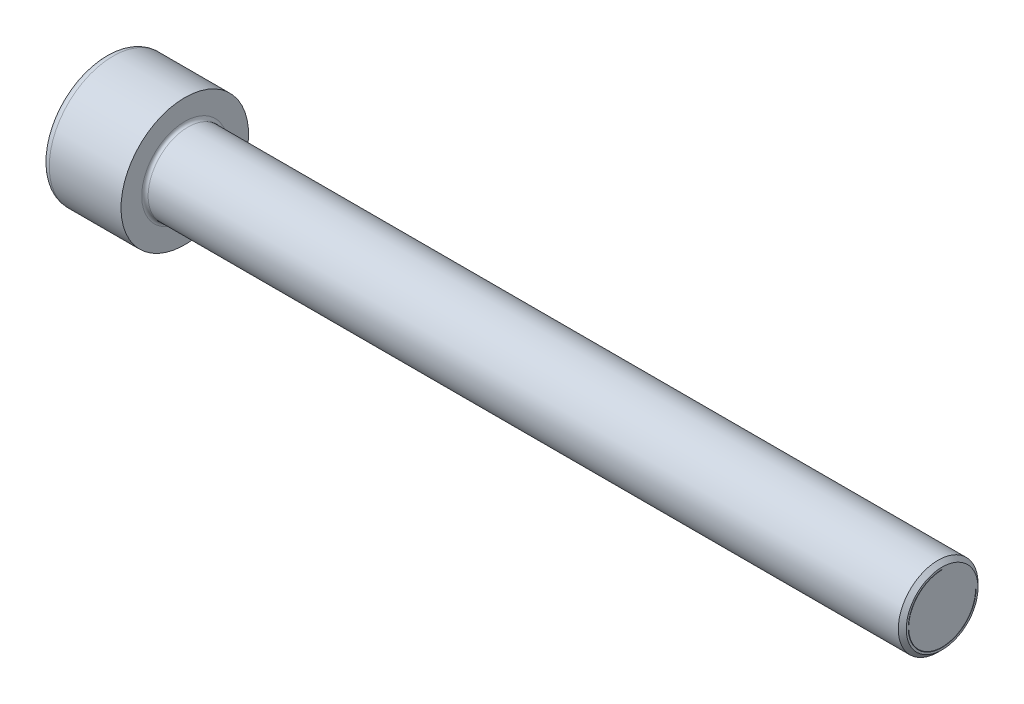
ISO-10303-21;
HEADER;
FILE_DESCRIPTION(('STEP AP214'),'2;1');
FILE_NAME('part.step','',(''),(''),'','','');
FILE_SCHEMA(('AUTOMOTIVE_DESIGN { 1 0 10303 214 1 1 1 1 }'));
ENDSEC;
DATA;
#1=APPLICATION_CONTEXT('core data for automotive mechanical design processes');
#2=APPLICATION_PROTOCOL_DEFINITION('international standard','automotive_design',2000,#1);
#3=PRODUCT_CONTEXT('',#1,'mechanical');
#4=PRODUCT('Part','Part','',(#3));
#5=PRODUCT_RELATED_PRODUCT_CATEGORY('part','',(#4));
#6=PRODUCT_DEFINITION_FORMATION('','',#4);
#7=PRODUCT_DEFINITION_CONTEXT('part definition',#1,'design');
#8=PRODUCT_DEFINITION('design','',#6,#7);
#9=PRODUCT_DEFINITION_SHAPE('','',#8);
#10=(LENGTH_UNIT() NAMED_UNIT(*) SI_UNIT(.MILLI.,.METRE.));
#11=(NAMED_UNIT(*) PLANE_ANGLE_UNIT() SI_UNIT($,.RADIAN.));
#12=(NAMED_UNIT(*) SI_UNIT($,.STERADIAN.) SOLID_ANGLE_UNIT());
#13=UNCERTAINTY_MEASURE_WITH_UNIT(LENGTH_MEASURE(1.E-05),#10,'distance_accuracy_value','');
#14=(GEOMETRIC_REPRESENTATION_CONTEXT(3) GLOBAL_UNCERTAINTY_ASSIGNED_CONTEXT((#13)) GLOBAL_UNIT_ASSIGNED_CONTEXT((#10,
#11,#12)) REPRESENTATION_CONTEXT('',''));
#15=CARTESIAN_POINT('',(0.,0.,0.));
#16=DIRECTION('',(0.,0.,1.));
#17=DIRECTION('',(1.,0.,0.));
#18=AXIS2_PLACEMENT_3D('',#15,#16,#17);
#19=CARTESIAN_POINT('',(62.9999999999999,2.5,0.));
#20=DIRECTION('',(1.,0.,0.));
#21=DIRECTION('',(0.,0.,-1.));
#22=AXIS2_PLACEMENT_3D('',#19,#20,#21);
#23=PLANE('',#22);
#24=DIRECTION('',(0.,0.,1.));
#25=VECTOR('',#24,1.);
#26=CARTESIAN_POINT('',(62.9999999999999,0.,-2.1125));
#27=LINE('',#26,#25);
#28=CARTESIAN_POINT('',(62.9999999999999,0.,-4.25000000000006));
#29=VERTEX_POINT('',#28);
#30=CARTESIAN_POINT('',(62.9999999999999,0.,-4.20000000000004));
#31=VERTEX_POINT('',#30);
#32=EDGE_CURVE('E298',#29,#31,#27,.T.);
#33=ORIENTED_EDGE('',*,*,#32,.T.);
#34=CARTESIAN_POINT('',(62.9999999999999,0.,0.));
#35=DIRECTION('',(-1.,0.,0.));
#36=DIRECTION('',(0.,1.,0.));
#37=AXIS2_PLACEMENT_3D('',#34,#35,#36);
#38=CIRCLE('',#37,4.2);
#39=CARTESIAN_POINT('',(62.9999999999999,4.20000000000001,0.));
#40=VERTEX_POINT('',#39);
#41=EDGE_CURVE('E266',#31,#40,#38,.T.);
#42=ORIENTED_EDGE('',*,*,#41,.T.);
#43=DIRECTION('',(0.,1.,0.));
#44=VECTOR('',#43,1.);
#45=CARTESIAN_POINT('',(62.9999999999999,3.36250000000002,0.));
#46=LINE('',#45,#44);
#47=CARTESIAN_POINT('',(62.9999999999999,4.25,0.));
#48=VERTEX_POINT('',#47);
#49=EDGE_CURVE('E58',#40,#48,#46,.T.);
#50=ORIENTED_EDGE('',*,*,#49,.T.);
#51=CARTESIAN_POINT('',(62.9999999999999,0.,0.));
#52=DIRECTION('',(1.,0.,0.));
#53=DIRECTION('',(0.,1.,0.));
#54=AXIS2_PLACEMENT_3D('',#51,#52,#53);
#55=CIRCLE('',#54,4.25);
#56=EDGE_CURVE('E273',#48,#29,#55,.T.);
#57=ORIENTED_EDGE('',*,*,#56,.T.);
#58=EDGE_LOOP('',(#33,#42,#50,#57));
#59=FACE_BOUND('',#58,.T.);
#60=ADVANCED_FACE('F40',(#59),#23,.T.);
#61=CARTESIAN_POINT('',(31.7000000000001,0.,0.));
#62=DIRECTION('',(-1.,0.,0.));
#63=DIRECTION('',(0.,0.,1.));
#64=AXIS2_PLACEMENT_3D('',#61,#62,#63);
#65=CYLINDRICAL_SURFACE('',#64,5.);
#66=CARTESIAN_POINT('',(94.5,0.,0.));
#67=DIRECTION('',(1.,0.,0.));
#68=DIRECTION('',(0.,0.,-1.));
#69=AXIS2_PLACEMENT_3D('',#66,#67,#68);
#70=CIRCLE('',#69,5.);
#71=CARTESIAN_POINT('',(94.5,0.,-5.00000000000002));
#72=VERTEX_POINT('',#71);
#73=EDGE_CURVE('E11',#72,#72,#70,.F.);
#74=ORIENTED_EDGE('',*,*,#73,.T.);
#75=EDGE_LOOP('',(#74));
#76=FACE_BOUND('',#75,.T.);
#77=CARTESIAN_POINT('',(0.399999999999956,0.,0.));
#78=DIRECTION('',(1.,0.,0.));
#79=DIRECTION('',(0.,1.,0.));
#80=AXIS2_PLACEMENT_3D('',#77,#78,#79);
#81=CIRCLE('',#80,5.);
#82=CARTESIAN_POINT('',(0.399999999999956,5.00000000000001,0.));
#83=VERTEX_POINT('',#82);
#84=EDGE_CURVE('E281',#83,#83,#81,.T.);
#85=ORIENTED_EDGE('',*,*,#84,.T.);
#86=EDGE_LOOP('',(#85));
#87=FACE_BOUND('',#86,.T.);
#88=ADVANCED_FACE('F192',(#76,#87),#65,.T.);
#89=CARTESIAN_POINT('',(0.399999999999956,0.,0.));
#90=DIRECTION('',(1.,0.,0.));
#91=DIRECTION('',(0.,0.,-1.));
#92=AXIS2_PLACEMENT_3D('',#89,#90,#91);
#93=TOROIDAL_SURFACE('',#92,5.40000000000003,0.4);
#94=CARTESIAN_POINT('',(0.,0.,0.));
#95=DIRECTION('',(1.,0.,0.));
#96=DIRECTION('',(0.,1.,0.));
#97=AXIS2_PLACEMENT_3D('',#94,#95,#96);
#98=CIRCLE('',#97,5.4);
#99=CARTESIAN_POINT('',(0.,5.40000000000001,0.));
#100=VERTEX_POINT('',#99);
#101=EDGE_CURVE('E165',#100,#100,#98,.T.);
#102=ORIENTED_EDGE('',*,*,#101,.T.);
#103=EDGE_LOOP('',(#102));
#104=FACE_BOUND('',#103,.T.);
#105=ORIENTED_EDGE('',*,*,#84,.F.);
#106=EDGE_LOOP('',(#105));
#107=FACE_BOUND('',#106,.T.);
#108=ADVANCED_FACE('F187',(#104,#107),#93,.F.);
#109=CARTESIAN_POINT('',(0.,6.70000000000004,0.));
#110=DIRECTION('',(1.,0.,0.));
#111=DIRECTION('',(0.,0.,-1.));
#112=AXIS2_PLACEMENT_3D('',#109,#110,#111);
#113=PLANE('',#112);
#114=CARTESIAN_POINT('',(0.,0.,0.));
#115=DIRECTION('',(1.,0.,0.));
#116=DIRECTION('',(0.,1.,0.));
#117=AXIS2_PLACEMENT_3D('',#114,#115,#116);
#118=CIRCLE('',#117,8.);
#119=CARTESIAN_POINT('',(0.,8.00000000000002,0.));
#120=VERTEX_POINT('',#119);
#121=EDGE_CURVE('E294',#120,#120,#118,.T.);
#122=ORIENTED_EDGE('',*,*,#121,.T.);
#123=EDGE_LOOP('',(#122));
#124=FACE_BOUND('',#123,.T.);
#125=ORIENTED_EDGE('',*,*,#101,.F.);
#126=EDGE_LOOP('',(#125));
#127=FACE_BOUND('',#126,.T.);
#128=ADVANCED_FACE('F191',(#124,#127),#113,.T.);
#129=CARTESIAN_POINT('',(-4.49999999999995,0.,0.));
#130=DIRECTION('',(-1.,0.,0.));
#131=DIRECTION('',(0.,0.,1.));
#132=AXIS2_PLACEMENT_3D('',#129,#130,#131);
#133=CYLINDRICAL_SURFACE('',#132,8.);
#134=CARTESIAN_POINT('',(-8.9999999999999,0.,0.));
#135=DIRECTION('',(1.,0.,0.));
#136=DIRECTION('',(0.,1.,0.));
#137=AXIS2_PLACEMENT_3D('',#134,#135,#136);
#138=CIRCLE('',#137,8.);
#139=CARTESIAN_POINT('',(-8.9999999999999,8.00000000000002,0.));
#140=VERTEX_POINT('',#139);
#141=EDGE_CURVE('E299',#140,#140,#138,.T.);
#142=ORIENTED_EDGE('',*,*,#141,.T.);
#143=EDGE_LOOP('',(#142));
#144=FACE_BOUND('',#143,.T.);
#145=ORIENTED_EDGE('',*,*,#121,.F.);
#146=EDGE_LOOP('',(#145));
#147=FACE_BOUND('',#146,.T.);
#148=ADVANCED_FACE('F197',(#144,#147),#133,.T.);
#149=CARTESIAN_POINT('',(-8.9999999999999,0.,0.));
#150=DIRECTION('',(1.,0.,0.));
#151=DIRECTION('',(0.,0.,-1.));
#152=AXIS2_PLACEMENT_3D('',#149,#150,#151);
#153=TOROIDAL_SURFACE('',#152,7.00000000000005,1.);
#154=CARTESIAN_POINT('',(-10.,0.,0.));
#155=DIRECTION('',(1.,0.,0.));
#156=DIRECTION('',(0.,1.,0.));
#157=AXIS2_PLACEMENT_3D('',#154,#155,#156);
#158=CIRCLE('',#157,7.);
#159=CARTESIAN_POINT('',(-10.,7.00000000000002,0.));
#160=VERTEX_POINT('',#159);
#161=EDGE_CURVE('E288',#160,#160,#158,.T.);
#162=ORIENTED_EDGE('',*,*,#161,.T.);
#163=EDGE_LOOP('',(#162));
#164=FACE_BOUND('',#163,.T.);
#165=ORIENTED_EDGE('',*,*,#141,.F.);
#166=EDGE_LOOP('',(#165));
#167=FACE_BOUND('',#166,.T.);
#168=ADVANCED_FACE('F201',(#164,#167),#153,.T.);
#169=CARTESIAN_POINT('',(-10.,3.50000000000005,0.));
#170=DIRECTION('',(-1.,0.,0.));
#171=DIRECTION('',(0.,0.,1.));
#172=AXIS2_PLACEMENT_3D('',#169,#170,#171);
#173=PLANE('',#172);
#174=ORIENTED_EDGE('',*,*,#161,.F.);
#175=EDGE_LOOP('',(#174));
#176=FACE_BOUND('',#175,.T.);
#177=DIRECTION('',(0.,-0.500000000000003,-0.866025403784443));
#178=VECTOR('',#177,1.);
#179=CARTESIAN_POINT('',(-10.,-2.44925134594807,3.75777222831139));
#180=LINE('',#179,#178);
#181=CARTESIAN_POINT('',(-10.,-2.30940107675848,3.99999999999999));
#182=VERTEX_POINT('',#181);
#183=CARTESIAN_POINT('',(-10.,-4.61880215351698,0.));
#184=VERTEX_POINT('',#183);
#185=EDGE_CURVE('E146',#182,#184,#180,.T.);
#186=ORIENTED_EDGE('',*,*,#185,.T.);
#187=DIRECTION('',(0.,0.499999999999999,-0.866025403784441));
#188=VECTOR('',#187,1.);
#189=CARTESIAN_POINT('',(-10.,-3.60395188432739,-1.75777222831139));
#190=LINE('',#189,#188);
#191=CARTESIAN_POINT('',(-10.,-2.30940107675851,-4.00000000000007));
#192=VERTEX_POINT('',#191);
#193=EDGE_CURVE('E289',#184,#192,#190,.T.);
#194=ORIENTED_EDGE('',*,*,#193,.T.);
#195=DIRECTION('',(0.,1.,0.));
#196=VECTOR('',#195,1.);
#197=CARTESIAN_POINT('',(-10.,0.595299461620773,-4.00000000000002));
#198=LINE('',#197,#196);
#199=CARTESIAN_POINT('',(-10.,2.30940107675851,-4.00000000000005));
#200=VERTEX_POINT('',#199);
#201=EDGE_CURVE('E293',#192,#200,#198,.T.);
#202=ORIENTED_EDGE('',*,*,#201,.T.);
#203=DIRECTION('',(0.,0.500000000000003,0.866025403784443));
#204=VECTOR('',#203,1.);
#205=CARTESIAN_POINT('',(-10.,3.32425134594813,-2.24222777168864));
#206=LINE('',#205,#204);
#207=CARTESIAN_POINT('',(-10.,4.61880215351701,0.));
#208=VERTEX_POINT('',#207);
#209=EDGE_CURVE('E284',#200,#208,#206,.T.);
#210=ORIENTED_EDGE('',*,*,#209,.T.);
#211=DIRECTION('',(0.,-0.499999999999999,0.866025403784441));
#212=VECTOR('',#211,1.);
#213=CARTESIAN_POINT('',(-10.,4.47895188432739,0.242227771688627));
#214=LINE('',#213,#212);
#215=CARTESIAN_POINT('',(-10.,2.30940107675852,4.));
#216=VERTEX_POINT('',#215);
#217=EDGE_CURVE('E282',#208,#216,#214,.T.);
#218=ORIENTED_EDGE('',*,*,#217,.T.);
#219=DIRECTION('',(0.,-1.,0.));
#220=VECTOR('',#219,1.);
#221=CARTESIAN_POINT('',(-10.,2.90470053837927,4.00000000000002));
#222=LINE('',#221,#220);
#223=EDGE_CURVE('E96',#216,#182,#222,.T.);
#224=ORIENTED_EDGE('',*,*,#223,.T.);
#225=EDGE_LOOP('',(#186,#194,#202,#210,#218,#224));
#226=FACE_BOUND('',#225,.T.);
#227=ADVANCED_FACE('F205',(#176,#226),#173,.T.);
#228=CARTESIAN_POINT('',(-4.99999999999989,0.,0.));
#229=DIRECTION('',(-1.,0.,0.));
#230=DIRECTION('',(0.,0.,1.));
#231=AXIS2_PLACEMENT_3D('',#228,#229,#230);
#232=PLANE('',#231);
#233=DIRECTION('',(0.,1.,0.));
#234=VECTOR('',#233,1.);
#235=CARTESIAN_POINT('',(-4.99999999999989,-2.30940107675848,3.99999999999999));
#236=LINE('',#235,#234);
#237=CARTESIAN_POINT('',(-4.99999999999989,-2.30940107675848,3.99999999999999));
#238=VERTEX_POINT('',#237);
#239=CARTESIAN_POINT('',(-4.99999999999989,2.30940107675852,4.));
#240=VERTEX_POINT('',#239);
#241=EDGE_CURVE('E126',#238,#240,#236,.T.);
#242=ORIENTED_EDGE('',*,*,#241,.T.);
#243=DIRECTION('',(0.,0.499999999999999,-0.866025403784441));
#244=VECTOR('',#243,1.);
#245=CARTESIAN_POINT('',(-4.99999999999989,2.30940107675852,4.));
#246=LINE('',#245,#244);
#247=CARTESIAN_POINT('',(-4.99999999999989,4.61880215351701,0.));
#248=VERTEX_POINT('',#247);
#249=EDGE_CURVE('E104',#240,#248,#246,.T.);
#250=ORIENTED_EDGE('',*,*,#249,.T.);
#251=DIRECTION('',(0.,-0.500000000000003,-0.866025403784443));
#252=VECTOR('',#251,1.);
#253=CARTESIAN_POINT('',(-4.99999999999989,4.61880215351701,0.));
#254=LINE('',#253,#252);
#255=CARTESIAN_POINT('',(-4.99999999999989,2.30940107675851,-4.00000000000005));
#256=VERTEX_POINT('',#255);
#257=EDGE_CURVE('E177',#248,#256,#254,.T.);
#258=ORIENTED_EDGE('',*,*,#257,.T.);
#259=DIRECTION('',(0.,-1.,0.));
#260=VECTOR('',#259,1.);
#261=CARTESIAN_POINT('',(-4.99999999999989,2.30940107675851,-4.00000000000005));
#262=LINE('',#261,#260);
#263=CARTESIAN_POINT('',(-4.99999999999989,-2.30940107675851,-4.00000000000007));
#264=VERTEX_POINT('',#263);
#265=EDGE_CURVE('E159',#256,#264,#262,.T.);
#266=ORIENTED_EDGE('',*,*,#265,.T.);
#267=DIRECTION('',(0.,-0.499999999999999,0.866025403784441));
#268=VECTOR('',#267,1.);
#269=CARTESIAN_POINT('',(-4.99999999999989,-2.30940107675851,-4.00000000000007));
#270=LINE('',#269,#268);
#271=CARTESIAN_POINT('',(-4.99999999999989,-4.61880215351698,0.));
#272=VERTEX_POINT('',#271);
#273=EDGE_CURVE('E130',#264,#272,#270,.T.);
#274=ORIENTED_EDGE('',*,*,#273,.T.);
#275=DIRECTION('',(0.,0.500000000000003,0.866025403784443));
#276=VECTOR('',#275,1.);
#277=CARTESIAN_POINT('',(-4.99999999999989,-4.61880215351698,0.));
#278=LINE('',#277,#276);
#279=EDGE_CURVE('E123',#272,#238,#278,.T.);
#280=ORIENTED_EDGE('',*,*,#279,.T.);
#281=EDGE_LOOP('',(#242,#250,#258,#266,#274,#280));
#282=FACE_BOUND('',#281,.T.);
#283=ADVANCED_FACE('F125',(#282),#232,.T.);
#284=CARTESIAN_POINT('',(-4.99999999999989,-2.30940107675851,-4.00000000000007));
#285=DIRECTION('',(0.,0.,1.));
#286=DIRECTION('',(1.,0.,0.));
#287=AXIS2_PLACEMENT_3D('',#284,#285,#286);
#288=PLANE('',#287);
#289=ORIENTED_EDGE('',*,*,#201,.F.);
#290=DIRECTION('',(-1.,0.,0.));
#291=VECTOR('',#290,1.);
#292=CARTESIAN_POINT('',(-4.99999999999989,-2.30940107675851,-4.00000000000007));
#293=LINE('',#292,#291);
#294=EDGE_CURVE('E152',#264,#192,#293,.T.);
#295=ORIENTED_EDGE('',*,*,#294,.F.);
#296=ORIENTED_EDGE('',*,*,#265,.F.);
#297=DIRECTION('',(-1.,0.,0.));
#298=VECTOR('',#297,1.);
#299=CARTESIAN_POINT('',(-4.99999999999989,2.30940107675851,-4.00000000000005));
#300=LINE('',#299,#298);
#301=EDGE_CURVE('E136',#256,#200,#300,.T.);
#302=ORIENTED_EDGE('',*,*,#301,.T.);
#303=EDGE_LOOP('',(#289,#295,#296,#302));
#304=FACE_BOUND('',#303,.T.);
#305=ADVANCED_FACE('F212',(#304),#288,.T.);
#306=CARTESIAN_POINT('',(-4.99999999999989,-4.61880215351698,0.));
#307=DIRECTION('',(0.,0.866025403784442,0.500000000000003));
#308=DIRECTION('',(0.,-0.499999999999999,0.866025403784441));
#309=AXIS2_PLACEMENT_3D('',#306,#307,#308);
#310=PLANE('',#309);
#311=ORIENTED_EDGE('',*,*,#193,.F.);
#312=DIRECTION('',(-1.,0.,0.));
#313=VECTOR('',#312,1.);
#314=CARTESIAN_POINT('',(-4.99999999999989,-4.61880215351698,0.));
#315=LINE('',#314,#313);
#316=EDGE_CURVE('E148',#272,#184,#315,.T.);
#317=ORIENTED_EDGE('',*,*,#316,.F.);
#318=ORIENTED_EDGE('',*,*,#273,.F.);
#319=ORIENTED_EDGE('',*,*,#294,.T.);
#320=EDGE_LOOP('',(#311,#317,#318,#319));
#321=FACE_BOUND('',#320,.T.);
#322=ADVANCED_FACE('F215',(#321),#310,.T.);
#323=CARTESIAN_POINT('',(-4.99999999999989,-2.30940107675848,3.99999999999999));
#324=DIRECTION('',(0.,0.86602540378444,-0.5));
#325=DIRECTION('',(0.,0.500000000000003,0.866025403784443));
#326=AXIS2_PLACEMENT_3D('',#323,#324,#325);
#327=PLANE('',#326);
#328=ORIENTED_EDGE('',*,*,#185,.F.);
#329=DIRECTION('',(-1.,0.,0.));
#330=VECTOR('',#329,1.);
#331=CARTESIAN_POINT('',(-4.99999999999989,-2.30940107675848,3.99999999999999));
#332=LINE('',#331,#330);
#333=EDGE_CURVE('E141',#238,#182,#332,.T.);
#334=ORIENTED_EDGE('',*,*,#333,.F.);
#335=ORIENTED_EDGE('',*,*,#279,.F.);
#336=ORIENTED_EDGE('',*,*,#316,.T.);
#337=EDGE_LOOP('',(#328,#334,#335,#336));
#338=FACE_BOUND('',#337,.T.);
#339=ADVANCED_FACE('F145',(#338),#327,.T.);
#340=CARTESIAN_POINT('',(-4.99999999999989,2.30940107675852,4.));
#341=DIRECTION('',(0.,0.,-1.));
#342=DIRECTION('',(-1.,0.,0.));
#343=AXIS2_PLACEMENT_3D('',#340,#341,#342);
#344=PLANE('',#343);
#345=ORIENTED_EDGE('',*,*,#223,.F.);
#346=DIRECTION('',(-1.,0.,0.));
#347=VECTOR('',#346,1.);
#348=CARTESIAN_POINT('',(-4.99999999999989,2.30940107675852,4.));
#349=LINE('',#348,#347);
#350=EDGE_CURVE('E142',#240,#216,#349,.T.);
#351=ORIENTED_EDGE('',*,*,#350,.F.);
#352=ORIENTED_EDGE('',*,*,#241,.F.);
#353=ORIENTED_EDGE('',*,*,#333,.T.);
#354=EDGE_LOOP('',(#345,#351,#352,#353));
#355=FACE_BOUND('',#354,.T.);
#356=ADVANCED_FACE('F140',(#355),#344,.T.);
#357=CARTESIAN_POINT('',(-4.99999999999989,4.61880215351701,0.));
#358=DIRECTION('',(0.,-0.866025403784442,-0.500000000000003));
#359=DIRECTION('',(0.,0.499999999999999,-0.866025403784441));
#360=AXIS2_PLACEMENT_3D('',#357,#358,#359);
#361=PLANE('',#360);
#362=ORIENTED_EDGE('',*,*,#217,.F.);
#363=DIRECTION('',(-1.,0.,0.));
#364=VECTOR('',#363,1.);
#365=CARTESIAN_POINT('',(-4.99999999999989,4.61880215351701,0.));
#366=LINE('',#365,#364);
#367=EDGE_CURVE('E155',#248,#208,#366,.T.);
#368=ORIENTED_EDGE('',*,*,#367,.F.);
#369=ORIENTED_EDGE('',*,*,#249,.F.);
#370=ORIENTED_EDGE('',*,*,#350,.T.);
#371=EDGE_LOOP('',(#362,#368,#369,#370));
#372=FACE_BOUND('',#371,.T.);
#373=ADVANCED_FACE('F224',(#372),#361,.T.);
#374=CARTESIAN_POINT('',(-4.99999999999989,2.30940107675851,-4.00000000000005));
#375=DIRECTION('',(0.,-0.86602540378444,0.5));
#376=DIRECTION('',(0.,-0.500000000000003,-0.866025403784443));
#377=AXIS2_PLACEMENT_3D('',#374,#375,#376);
#378=PLANE('',#377);
#379=ORIENTED_EDGE('',*,*,#209,.F.);
#380=ORIENTED_EDGE('',*,*,#301,.F.);
#381=ORIENTED_EDGE('',*,*,#257,.F.);
#382=ORIENTED_EDGE('',*,*,#367,.T.);
#383=EDGE_LOOP('',(#379,#380,#381,#382));
#384=FACE_BOUND('',#383,.T.);
#385=ADVANCED_FACE('F227',(#384),#378,.T.);
#386=CARTESIAN_POINT('',(95.,0.,0.));
#387=DIRECTION('',(1.,0.,0.));
#388=DIRECTION('',(0.,0.,-1.));
#389=AXIS2_PLACEMENT_3D('',#386,#387,#388);
#390=PLANE('',#389);
#391=CARTESIAN_POINT('',(95.,0.,0.));
#392=DIRECTION('',(1.,0.,0.));
#393=DIRECTION('',(0.,0.,-1.));
#394=AXIS2_PLACEMENT_3D('',#391,#392,#393);
#395=CIRCLE('',#394,4.49999999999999);
#396=CARTESIAN_POINT('',(95.,0.,-4.5));
#397=VERTEX_POINT('',#396);
#398=EDGE_CURVE('E50',#397,#397,#395,.T.);
#399=ORIENTED_EDGE('',*,*,#398,.T.);
#400=EDGE_LOOP('',(#399));
#401=FACE_BOUND('',#400,.T.);
#402=CARTESIAN_POINT('',(95.,0.,0.));
#403=DIRECTION('',(1.,0.,0.));
#404=DIRECTION('',(0.,1.,0.));
#405=AXIS2_PLACEMENT_3D('',#402,#403,#404);
#406=CIRCLE('',#405,4.2);
#407=CARTESIAN_POINT('',(95.,4.20000000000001,0.));
#408=VERTEX_POINT('',#407);
#409=CARTESIAN_POINT('',(95.,0.,-4.20000000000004));
#410=VERTEX_POINT('',#409);
#411=EDGE_CURVE('E307',#408,#410,#406,.T.);
#412=ORIENTED_EDGE('',*,*,#411,.T.);
#413=DIRECTION('',(0.,0.,-1.));
#414=VECTOR('',#413,1.);
#415=CARTESIAN_POINT('',(95.,0.,-2.1125));
#416=LINE('',#415,#414);
#417=CARTESIAN_POINT('',(95.,0.,-4.25000000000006));
#418=VERTEX_POINT('',#417);
#419=EDGE_CURVE('E310',#410,#418,#416,.T.);
#420=ORIENTED_EDGE('',*,*,#419,.T.);
#421=CARTESIAN_POINT('',(95.,0.,0.));
#422=DIRECTION('',(-1.,0.,0.));
#423=DIRECTION('',(0.,1.,0.));
#424=AXIS2_PLACEMENT_3D('',#421,#422,#423);
#425=CIRCLE('',#424,4.25);
#426=CARTESIAN_POINT('',(95.,4.25,0.));
#427=VERTEX_POINT('',#426);
#428=EDGE_CURVE('E318',#418,#427,#425,.T.);
#429=ORIENTED_EDGE('',*,*,#428,.T.);
#430=DIRECTION('',(0.,-1.,0.));
#431=VECTOR('',#430,1.);
#432=CARTESIAN_POINT('',(95.,2.11250000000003,0.));
#433=LINE('',#432,#431);
#434=EDGE_CURVE('E173',#427,#408,#433,.T.);
#435=ORIENTED_EDGE('',*,*,#434,.T.);
#436=EDGE_LOOP('',(#412,#420,#429,#435));
#437=FACE_BOUND('',#436,.T.);
#438=ADVANCED_FACE('F230',(#401,#437),#390,.T.);
#439=CARTESIAN_POINT('',(79.,0.,-4.22500000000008));
#440=DIRECTION('',(0.,-1.,0.));
#441=DIRECTION('',(0.,0.,-1.));
#442=AXIS2_PLACEMENT_3D('',#439,#440,#441);
#443=PLANE('',#442);
#444=DIRECTION('',(1.,0.,0.));
#445=VECTOR('',#444,1.);
#446=CARTESIAN_POINT('',(95.,0.,-4.25000000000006));
#447=LINE('',#446,#445);
#448=EDGE_CURVE('E170',#29,#418,#447,.T.);
#449=ORIENTED_EDGE('',*,*,#448,.T.);
#450=ORIENTED_EDGE('',*,*,#419,.F.);
#451=DIRECTION('',(-1.,0.,0.));
#452=VECTOR('',#451,1.);
#453=CARTESIAN_POINT('',(62.9999999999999,0.,-4.20000000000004));
#454=LINE('',#453,#452);
#455=EDGE_CURVE('E166',#410,#31,#454,.T.);
#456=ORIENTED_EDGE('',*,*,#455,.T.);
#457=ORIENTED_EDGE('',*,*,#32,.F.);
#458=EDGE_LOOP('',(#449,#450,#456,#457));
#459=FACE_BOUND('',#458,.T.);
#460=ADVANCED_FACE('F234',(#459),#443,.T.);
#461=CARTESIAN_POINT('',(79.,4.22500000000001,0.));
#462=DIRECTION('',(0.,0.,1.));
#463=DIRECTION('',(1.,0.,0.));
#464=AXIS2_PLACEMENT_3D('',#461,#462,#463);
#465=PLANE('',#464);
#466=ORIENTED_EDGE('',*,*,#49,.F.);
#467=DIRECTION('',(1.,0.,0.));
#468=VECTOR('',#467,1.);
#469=CARTESIAN_POINT('',(62.9999999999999,4.20000000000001,0.));
#470=LINE('',#469,#468);
#471=EDGE_CURVE('E164',#40,#408,#470,.T.);
#472=ORIENTED_EDGE('',*,*,#471,.T.);
#473=ORIENTED_EDGE('',*,*,#434,.F.);
#474=DIRECTION('',(-1.,0.,0.));
#475=VECTOR('',#474,1.);
#476=CARTESIAN_POINT('',(95.,4.25,0.));
#477=LINE('',#476,#475);
#478=EDGE_CURVE('E161',#427,#48,#477,.T.);
#479=ORIENTED_EDGE('',*,*,#478,.T.);
#480=EDGE_LOOP('',(#466,#472,#473,#479));
#481=FACE_BOUND('',#480,.T.);
#482=ADVANCED_FACE('F238',(#481),#465,.T.);
#483=CARTESIAN_POINT('',(79.,0.,0.));
#484=DIRECTION('',(-1.,0.,0.));
#485=DIRECTION('',(0.,0.,1.));
#486=AXIS2_PLACEMENT_3D('',#483,#484,#485);
#487=CYLINDRICAL_SURFACE('',#486,4.2);
#488=ORIENTED_EDGE('',*,*,#41,.F.);
#489=ORIENTED_EDGE('',*,*,#455,.F.);
#490=ORIENTED_EDGE('',*,*,#411,.F.);
#491=ORIENTED_EDGE('',*,*,#471,.F.);
#492=EDGE_LOOP('',(#488,#489,#490,#491));
#493=FACE_BOUND('',#492,.T.);
#494=ADVANCED_FACE('F241',(#493),#487,.T.);
#495=CARTESIAN_POINT('',(79.,0.,0.));
#496=DIRECTION('',(-1.,0.,0.));
#497=DIRECTION('',(0.,0.,1.));
#498=AXIS2_PLACEMENT_3D('',#495,#496,#497);
#499=CYLINDRICAL_SURFACE('',#498,4.25);
#500=ORIENTED_EDGE('',*,*,#448,.F.);
#501=ORIENTED_EDGE('',*,*,#56,.F.);
#502=ORIENTED_EDGE('',*,*,#478,.F.);
#503=ORIENTED_EDGE('',*,*,#428,.F.);
#504=EDGE_LOOP('',(#500,#501,#502,#503));
#505=FACE_BOUND('',#504,.T.);
#506=ADVANCED_FACE('F42',(#505),#499,.F.);
#507=CARTESIAN_POINT('',(95.,0.,0.));
#508=DIRECTION('',(-1.,0.,0.));
#509=DIRECTION('',(0.,0.,1.));
#510=AXIS2_PLACEMENT_3D('',#507,#508,#509);
#511=CONICAL_SURFACE('',#510,4.49999999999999,0.785398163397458);
#512=ORIENTED_EDGE('',*,*,#73,.F.);
#513=EDGE_LOOP('',(#512));
#514=FACE_BOUND('',#513,.T.);
#515=ORIENTED_EDGE('',*,*,#398,.F.);
#516=EDGE_LOOP('',(#515));
#517=FACE_BOUND('',#516,.T.);
#518=ADVANCED_FACE('F247',(#514,#517),#511,.T.);
#519=CLOSED_SHELL('',(#60,#88,#108,#128,#148,#168,#227,#283,#305,#322,#339,#356,#373,#385,#438,
#460,#482,#494,#506,#518));
#520=MANIFOLD_SOLID_BREP('B2',#519);
#521=ADVANCED_BREP_SHAPE_REPRESENTATION('',(#18,#520),#14);
#522=SHAPE_DEFINITION_REPRESENTATION(#9,#521);
ENDSEC;
END-ISO-10303-21;
